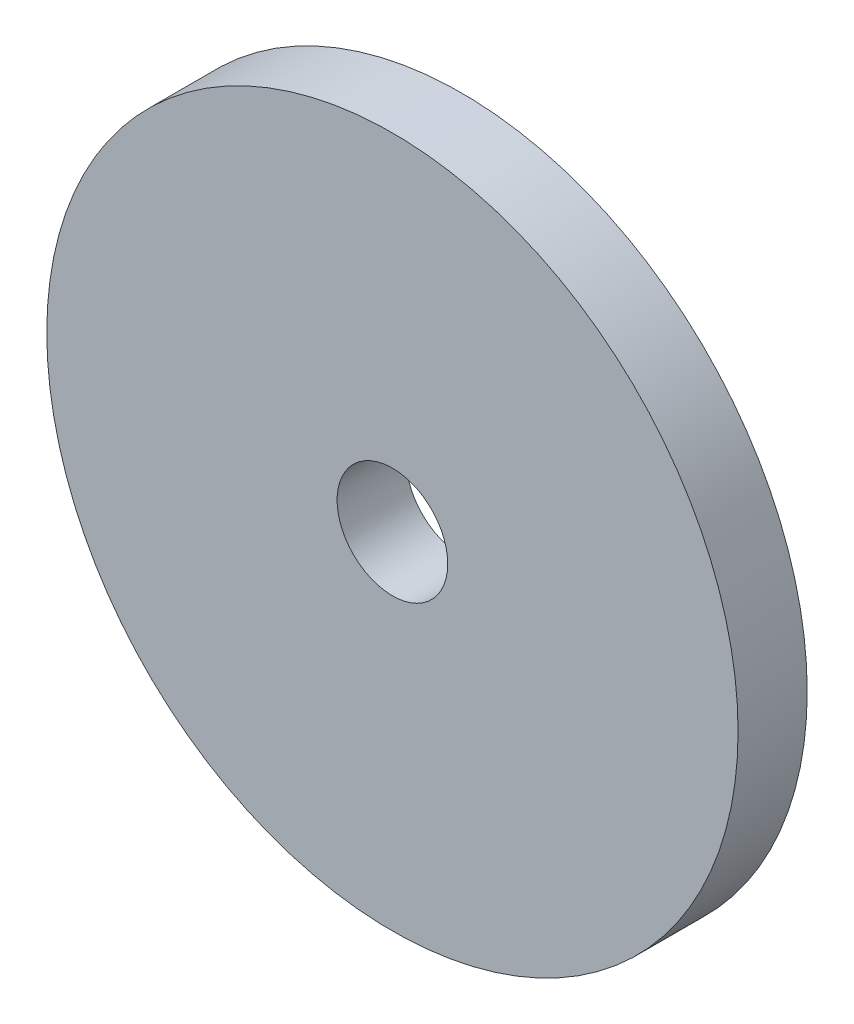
from build123d import *

# Parameters (mm, degrees)
SKETCH1_R           = 25
SKETCH1_R_2         = 4
BOSS_EXTRUDE2_DEPTH = 5


with BuildPart() as part:
    # Sketch1 → Boss-Extrude2 (new body)
    with BuildSketch(Plane.XY):
        Circle(SKETCH1_R)
        Circle(SKETCH1_R_2, mode=Mode.SUBTRACT)
    extrude(amount=BOSS_EXTRUDE2_DEPTH)


solid = part.part
